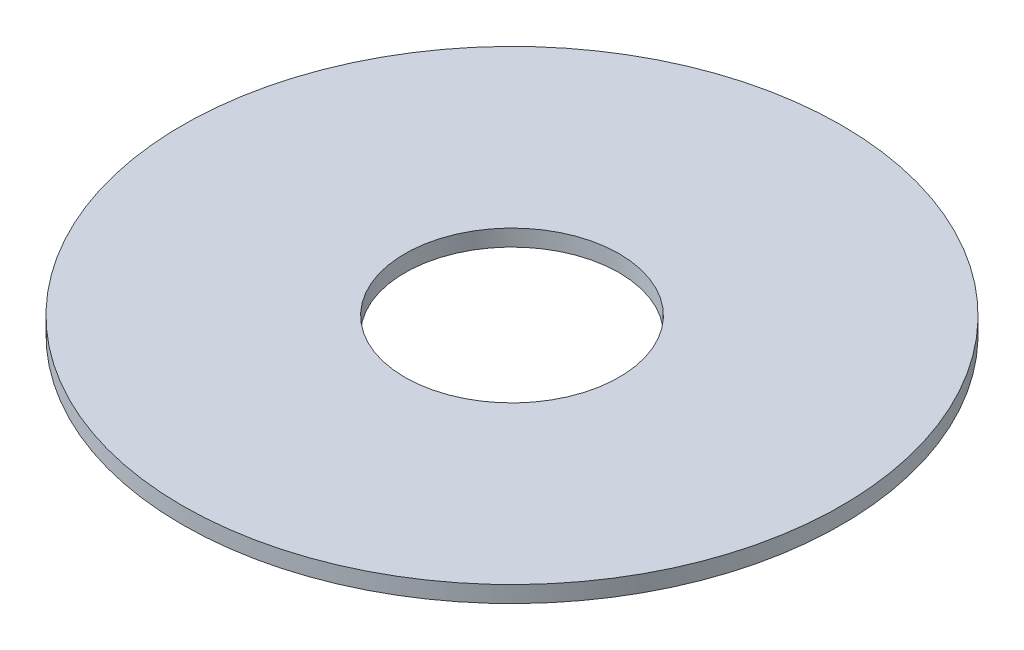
ISO-10303-21;
HEADER;
FILE_DESCRIPTION(('STEP AP214'),'2;1');
FILE_NAME('part.step','',(''),(''),'','','');
FILE_SCHEMA(('AUTOMOTIVE_DESIGN { 1 0 10303 214 1 1 1 1 }'));
ENDSEC;
DATA;
#1=APPLICATION_CONTEXT('core data for automotive mechanical design processes');
#2=APPLICATION_PROTOCOL_DEFINITION('international standard','automotive_design',2000,#1);
#3=PRODUCT_CONTEXT('',#1,'mechanical');
#4=PRODUCT('Part','Part','',(#3));
#5=PRODUCT_RELATED_PRODUCT_CATEGORY('part','',(#4));
#6=PRODUCT_DEFINITION_FORMATION('','',#4);
#7=PRODUCT_DEFINITION_CONTEXT('part definition',#1,'design');
#8=PRODUCT_DEFINITION('design','',#6,#7);
#9=PRODUCT_DEFINITION_SHAPE('','',#8);
#10=(LENGTH_UNIT() NAMED_UNIT(*) SI_UNIT(.MILLI.,.METRE.));
#11=(NAMED_UNIT(*) PLANE_ANGLE_UNIT() SI_UNIT($,.RADIAN.));
#12=(NAMED_UNIT(*) SI_UNIT($,.STERADIAN.) SOLID_ANGLE_UNIT());
#13=UNCERTAINTY_MEASURE_WITH_UNIT(LENGTH_MEASURE(1.E-05),#10,'distance_accuracy_value','');
#14=(GEOMETRIC_REPRESENTATION_CONTEXT(3) GLOBAL_UNCERTAINTY_ASSIGNED_CONTEXT((#13)) GLOBAL_UNIT_ASSIGNED_CONTEXT((#10,
#11,#12)) REPRESENTATION_CONTEXT('',''));
#15=CARTESIAN_POINT('',(0.,0.,0.));
#16=DIRECTION('',(0.,0.,1.));
#17=DIRECTION('',(1.,0.,0.));
#18=AXIS2_PLACEMENT_3D('',#15,#16,#17);
#19=CARTESIAN_POINT('',(0.,0.254,0.));
#20=DIRECTION('',(0.,-1.,0.));
#21=DIRECTION('',(0.,0.,-1.));
#22=AXIS2_PLACEMENT_3D('',#19,#20,#21);
#23=CYLINDRICAL_SURFACE('',#22,5.08);
#24=CARTESIAN_POINT('',(0.,0.254,0.));
#25=DIRECTION('',(0.,1.,0.));
#26=DIRECTION('',(0.,0.,1.));
#27=AXIS2_PLACEMENT_3D('',#24,#25,#26);
#28=CIRCLE('',#27,5.08);
#29=CARTESIAN_POINT('',(0.,0.254,5.08));
#30=VERTEX_POINT('',#29);
#31=EDGE_CURVE('E10',#30,#30,#28,.T.);
#32=ORIENTED_EDGE('',*,*,#31,.F.);
#33=EDGE_LOOP('',(#32));
#34=FACE_BOUND('',#33,.T.);
#35=CARTESIAN_POINT('',(0.,0.,0.));
#36=DIRECTION('',(0.,1.,0.));
#37=DIRECTION('',(0.,0.,1.));
#38=AXIS2_PLACEMENT_3D('',#35,#36,#37);
#39=CIRCLE('',#38,5.08);
#40=CARTESIAN_POINT('',(0.,0.,5.08));
#41=VERTEX_POINT('',#40);
#42=EDGE_CURVE('E35',#41,#41,#39,.T.);
#43=ORIENTED_EDGE('',*,*,#42,.T.);
#44=EDGE_LOOP('',(#43));
#45=FACE_BOUND('',#44,.T.);
#46=ADVANCED_FACE('F32',(#34,#45),#23,.T.);
#47=CARTESIAN_POINT('',(0.,0.254,0.));
#48=DIRECTION('',(0.,1.,0.));
#49=DIRECTION('',(0.,0.,1.));
#50=AXIS2_PLACEMENT_3D('',#47,#48,#49);
#51=PLANE('',#50);
#52=CARTESIAN_POINT('',(0.,0.254,0.));
#53=DIRECTION('',(0.,1.,0.));
#54=DIRECTION('',(0.,0.,1.));
#55=AXIS2_PLACEMENT_3D('',#52,#53,#54);
#56=CIRCLE('',#55,1.651);
#57=CARTESIAN_POINT('',(0.,0.254,1.651));
#58=VERTEX_POINT('',#57);
#59=EDGE_CURVE('E44',#58,#58,#56,.T.);
#60=ORIENTED_EDGE('',*,*,#59,.F.);
#61=EDGE_LOOP('',(#60));
#62=FACE_BOUND('',#61,.T.);
#63=ORIENTED_EDGE('',*,*,#31,.T.);
#64=EDGE_LOOP('',(#63));
#65=FACE_BOUND('',#64,.T.);
#66=ADVANCED_FACE('F59',(#62,#65),#51,.T.);
#67=CARTESIAN_POINT('',(0.,0.,0.));
#68=DIRECTION('',(0.,1.,0.));
#69=DIRECTION('',(0.,0.,1.));
#70=AXIS2_PLACEMENT_3D('',#67,#68,#69);
#71=PLANE('',#70);
#72=CARTESIAN_POINT('',(0.,0.,0.));
#73=DIRECTION('',(0.,1.,0.));
#74=DIRECTION('',(0.,0.,1.));
#75=AXIS2_PLACEMENT_3D('',#72,#73,#74);
#76=CIRCLE('',#75,1.651);
#77=CARTESIAN_POINT('',(0.,0.,1.651));
#78=VERTEX_POINT('',#77);
#79=EDGE_CURVE('E42',#78,#78,#76,.T.);
#80=ORIENTED_EDGE('',*,*,#79,.T.);
#81=EDGE_LOOP('',(#80));
#82=FACE_BOUND('',#81,.T.);
#83=ORIENTED_EDGE('',*,*,#42,.F.);
#84=EDGE_LOOP('',(#83));
#85=FACE_BOUND('',#84,.T.);
#86=ADVANCED_FACE('F50',(#82,#85),#71,.F.);
#87=CARTESIAN_POINT('',(0.,0.,0.));
#88=DIRECTION('',(0.,1.,0.));
#89=DIRECTION('',(0.,0.,1.));
#90=AXIS2_PLACEMENT_3D('',#87,#88,#89);
#91=CYLINDRICAL_SURFACE('',#90,1.651);
#92=ORIENTED_EDGE('',*,*,#79,.F.);
#93=EDGE_LOOP('',(#92));
#94=FACE_BOUND('',#93,.T.);
#95=ORIENTED_EDGE('',*,*,#59,.T.);
#96=EDGE_LOOP('',(#95));
#97=FACE_BOUND('',#96,.T.);
#98=ADVANCED_FACE('F53',(#94,#97),#91,.F.);
#99=CLOSED_SHELL('',(#46,#66,#86,#98));
#100=MANIFOLD_SOLID_BREP('B2',#99);
#101=ADVANCED_BREP_SHAPE_REPRESENTATION('',(#18,#100),#14);
#102=SHAPE_DEFINITION_REPRESENTATION(#9,#101);
ENDSEC;
END-ISO-10303-21;
